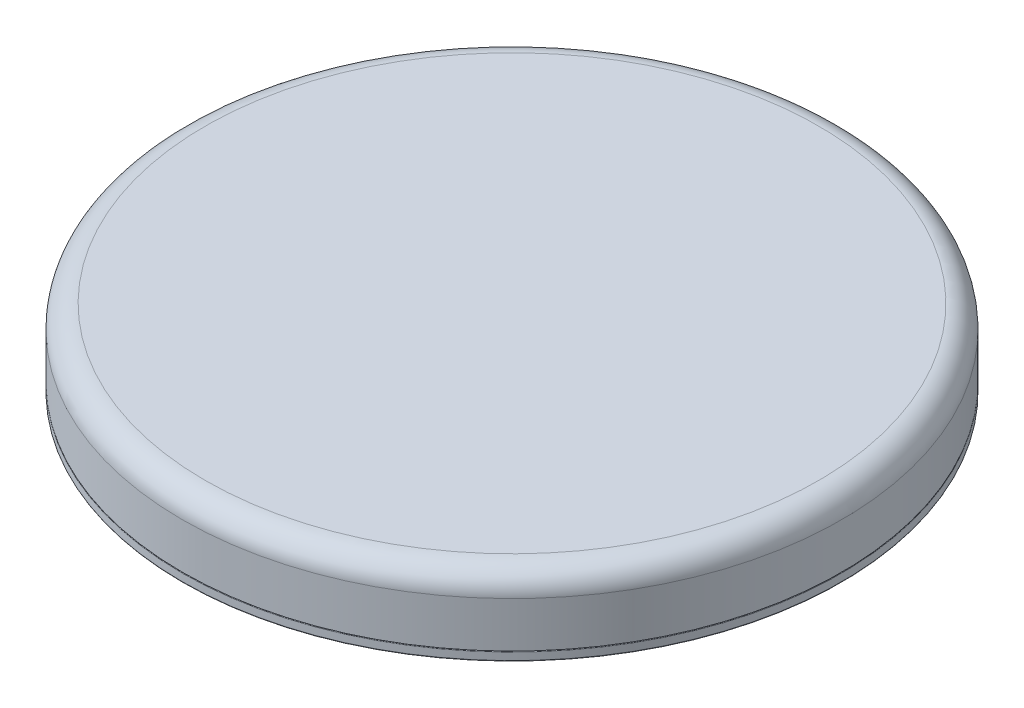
ISO-10303-21;
HEADER;
FILE_DESCRIPTION(('STEP AP214'),'2;1');
FILE_NAME('part.step','',(''),(''),'','','');
FILE_SCHEMA(('AUTOMOTIVE_DESIGN { 1 0 10303 214 1 1 1 1 }'));
ENDSEC;
DATA;
#1=APPLICATION_CONTEXT('core data for automotive mechanical design processes');
#2=APPLICATION_PROTOCOL_DEFINITION('international standard','automotive_design',2000,#1);
#3=PRODUCT_CONTEXT('',#1,'mechanical');
#4=PRODUCT('Part','Part','',(#3));
#5=PRODUCT_RELATED_PRODUCT_CATEGORY('part','',(#4));
#6=PRODUCT_DEFINITION_FORMATION('','',#4);
#7=PRODUCT_DEFINITION_CONTEXT('part definition',#1,'design');
#8=PRODUCT_DEFINITION('design','',#6,#7);
#9=PRODUCT_DEFINITION_SHAPE('','',#8);
#10=(LENGTH_UNIT() NAMED_UNIT(*) SI_UNIT(.MILLI.,.METRE.));
#11=(NAMED_UNIT(*) PLANE_ANGLE_UNIT() SI_UNIT($,.RADIAN.));
#12=(NAMED_UNIT(*) SI_UNIT($,.STERADIAN.) SOLID_ANGLE_UNIT());
#13=UNCERTAINTY_MEASURE_WITH_UNIT(LENGTH_MEASURE(1.E-05),#10,'distance_accuracy_value','');
#14=(GEOMETRIC_REPRESENTATION_CONTEXT(3) GLOBAL_UNCERTAINTY_ASSIGNED_CONTEXT((#13)) GLOBAL_UNIT_ASSIGNED_CONTEXT((#10,
#11,#12)) REPRESENTATION_CONTEXT('',''));
#15=CARTESIAN_POINT('',(0.,0.,0.));
#16=DIRECTION('',(0.,0.,1.));
#17=DIRECTION('',(1.,0.,0.));
#18=AXIS2_PLACEMENT_3D('',#15,#16,#17);
#19=CARTESIAN_POINT('',(0.,17.,0.));
#20=DIRECTION('',(0.,-1.,0.));
#21=DIRECTION('',(0.,0.,-1.));
#22=AXIS2_PLACEMENT_3D('',#19,#20,#21);
#23=CYLINDRICAL_SURFACE('',#22,72.5);
#24=CARTESIAN_POINT('',(0.,12.,0.));
#25=DIRECTION('',(0.,1.,0.));
#26=DIRECTION('',(0.,0.,1.));
#27=AXIS2_PLACEMENT_3D('',#24,#25,#26);
#28=CIRCLE('',#27,72.5);
#29=CARTESIAN_POINT('',(0.,12.,72.5));
#30=VERTEX_POINT('',#29);
#31=EDGE_CURVE('E11',#30,#30,#28,.F.);
#32=ORIENTED_EDGE('',*,*,#31,.T.);
#33=EDGE_LOOP('',(#32));
#34=FACE_BOUND('',#33,.T.);
#35=CARTESIAN_POINT('',(0.,2.,0.));
#36=DIRECTION('',(0.,1.,0.));
#37=DIRECTION('',(0.,0.,1.));
#38=AXIS2_PLACEMENT_3D('',#35,#36,#37);
#39=CIRCLE('',#38,72.5);
#40=CARTESIAN_POINT('',(0.,2.,72.5));
#41=VERTEX_POINT('',#40);
#42=EDGE_CURVE('E55',#41,#41,#39,.T.);
#43=ORIENTED_EDGE('',*,*,#42,.T.);
#44=EDGE_LOOP('',(#43));
#45=FACE_BOUND('',#44,.T.);
#46=ADVANCED_FACE('F44',(#34,#45),#23,.T.);
#47=CARTESIAN_POINT('',(0.,17.,0.));
#48=DIRECTION('',(0.,1.,0.));
#49=DIRECTION('',(0.,0.,1.));
#50=AXIS2_PLACEMENT_3D('',#47,#48,#49);
#51=PLANE('',#50);
#52=CARTESIAN_POINT('',(0.,17.,0.));
#53=DIRECTION('',(0.,1.,0.));
#54=DIRECTION('',(0.,0.,1.));
#55=AXIS2_PLACEMENT_3D('',#52,#53,#54);
#56=CIRCLE('',#55,67.5);
#57=CARTESIAN_POINT('',(0.,17.,67.5));
#58=VERTEX_POINT('',#57);
#59=EDGE_CURVE('E51',#58,#58,#56,.T.);
#60=ORIENTED_EDGE('',*,*,#59,.T.);
#61=EDGE_LOOP('',(#60));
#62=FACE_BOUND('',#61,.T.);
#63=ADVANCED_FACE('F65',(#62),#51,.T.);
#64=CARTESIAN_POINT('',(0.,2.,0.));
#65=DIRECTION('',(0.,1.,0.));
#66=DIRECTION('',(0.,0.,1.));
#67=AXIS2_PLACEMENT_3D('',#64,#65,#66);
#68=PLANE('',#67);
#69=ORIENTED_EDGE('',*,*,#42,.F.);
#70=EDGE_LOOP('',(#69));
#71=FACE_BOUND('',#70,.T.);
#72=ADVANCED_FACE('F63',(#71),#68,.F.);
#73=CARTESIAN_POINT('',(0.,12.,0.));
#74=DIRECTION('',(0.,1.,0.));
#75=DIRECTION('',(0.,0.,1.));
#76=AXIS2_PLACEMENT_3D('',#73,#74,#75);
#77=TOROIDAL_SURFACE('',#76,67.5,5.);
#78=ORIENTED_EDGE('',*,*,#31,.F.);
#79=EDGE_LOOP('',(#78));
#80=FACE_BOUND('',#79,.T.);
#81=ORIENTED_EDGE('',*,*,#59,.F.);
#82=EDGE_LOOP('',(#81));
#83=FACE_BOUND('',#82,.T.);
#84=ADVANCED_FACE('F46',(#80,#83),#77,.T.);
#85=CLOSED_SHELL('',(#46,#63,#72,#84));
#86=MANIFOLD_SOLID_BREP('B2',#85);
#87=CARTESIAN_POINT('',(0.,2.,0.));
#88=DIRECTION('',(0.,-1.,0.));
#89=DIRECTION('',(0.,0.,-1.));
#90=AXIS2_PLACEMENT_3D('',#87,#88,#89);
#91=CYLINDRICAL_SURFACE('',#90,72.5);
#92=CARTESIAN_POINT('',(0.,0.2,0.));
#93=DIRECTION('',(0.,1.,0.));
#94=DIRECTION('',(0.,0.,1.));
#95=AXIS2_PLACEMENT_3D('',#92,#93,#94);
#96=CIRCLE('',#95,72.5);
#97=CARTESIAN_POINT('',(0.,0.2,72.5));
#98=VERTEX_POINT('',#97);
#99=EDGE_CURVE('E131',#98,#98,#96,.T.);
#100=ORIENTED_EDGE('',*,*,#99,.T.);
#101=EDGE_LOOP('',(#100));
#102=FACE_BOUND('',#101,.T.);
#103=CARTESIAN_POINT('',(0.,1.8,0.));
#104=DIRECTION('',(0.,1.,0.));
#105=DIRECTION('',(0.,0.,1.));
#106=AXIS2_PLACEMENT_3D('',#103,#104,#105);
#107=CIRCLE('',#106,72.5);
#108=CARTESIAN_POINT('',(0.,1.8,72.5));
#109=VERTEX_POINT('',#108);
#110=EDGE_CURVE('E134',#109,#109,#107,.F.);
#111=ORIENTED_EDGE('',*,*,#110,.T.);
#112=EDGE_LOOP('',(#111));
#113=FACE_BOUND('',#112,.T.);
#114=ADVANCED_FACE('F99',(#102,#113),#91,.T.);
#115=CARTESIAN_POINT('',(0.,2.,0.));
#116=DIRECTION('',(0.,1.,0.));
#117=DIRECTION('',(0.,0.,1.));
#118=AXIS2_PLACEMENT_3D('',#115,#116,#117);
#119=PLANE('',#118);
#120=CARTESIAN_POINT('',(0.,2.,0.));
#121=DIRECTION('',(0.,1.,0.));
#122=DIRECTION('',(0.,0.,1.));
#123=AXIS2_PLACEMENT_3D('',#120,#121,#122);
#124=CIRCLE('',#123,72.3);
#125=CARTESIAN_POINT('',(0.,2.,72.3));
#126=VERTEX_POINT('',#125);
#127=EDGE_CURVE('E125',#126,#126,#124,.T.);
#128=ORIENTED_EDGE('',*,*,#127,.T.);
#129=EDGE_LOOP('',(#128));
#130=FACE_BOUND('',#129,.T.);
#131=ADVANCED_FACE('F161',(#130),#119,.T.);
#132=CARTESIAN_POINT('',(0.,0.,0.));
#133=DIRECTION('',(0.,1.,0.));
#134=DIRECTION('',(0.,0.,1.));
#135=AXIS2_PLACEMENT_3D('',#132,#133,#134);
#136=PLANE('',#135);
#137=CARTESIAN_POINT('',(0.,0.,0.));
#138=DIRECTION('',(0.,1.,0.));
#139=DIRECTION('',(0.,0.,1.));
#140=AXIS2_PLACEMENT_3D('',#137,#138,#139);
#141=CIRCLE('',#140,11.2);
#142=CARTESIAN_POINT('',(0.,0.,11.2));
#143=VERTEX_POINT('',#142);
#144=EDGE_CURVE('E114',#143,#143,#141,.T.);
#145=ORIENTED_EDGE('',*,*,#144,.T.);
#146=EDGE_LOOP('',(#145));
#147=FACE_BOUND('',#146,.T.);
#148=CARTESIAN_POINT('',(0.,0.,0.));
#149=DIRECTION('',(0.,1.,0.));
#150=DIRECTION('',(0.,0.,1.));
#151=AXIS2_PLACEMENT_3D('',#148,#149,#150);
#152=CIRCLE('',#151,72.3);
#153=CARTESIAN_POINT('',(0.,0.,72.3));
#154=VERTEX_POINT('',#153);
#155=EDGE_CURVE('E128',#154,#154,#152,.F.);
#156=ORIENTED_EDGE('',*,*,#155,.T.);
#157=EDGE_LOOP('',(#156));
#158=FACE_BOUND('',#157,.T.);
#159=ADVANCED_FACE('F167',(#147,#158),#136,.F.);
#160=CARTESIAN_POINT('',(0.,0.2,0.));
#161=DIRECTION('',(0.,1.,0.));
#162=DIRECTION('',(0.,0.,1.));
#163=AXIS2_PLACEMENT_3D('',#160,#161,#162);
#164=TOROIDAL_SURFACE('',#163,72.3,0.2);
#165=ORIENTED_EDGE('',*,*,#155,.F.);
#166=EDGE_LOOP('',(#165));
#167=FACE_BOUND('',#166,.T.);
#168=ORIENTED_EDGE('',*,*,#99,.F.);
#169=EDGE_LOOP('',(#168));
#170=FACE_BOUND('',#169,.T.);
#171=ADVANCED_FACE('F156',(#167,#170),#164,.T.);
#172=CARTESIAN_POINT('',(0.,1.8,0.));
#173=DIRECTION('',(0.,1.,0.));
#174=DIRECTION('',(0.,0.,1.));
#175=AXIS2_PLACEMENT_3D('',#172,#173,#174);
#176=TOROIDAL_SURFACE('',#175,72.3,0.2);
#177=ORIENTED_EDGE('',*,*,#110,.F.);
#178=EDGE_LOOP('',(#177));
#179=FACE_BOUND('',#178,.T.);
#180=ORIENTED_EDGE('',*,*,#127,.F.);
#181=EDGE_LOOP('',(#180));
#182=FACE_BOUND('',#181,.T.);
#183=ADVANCED_FACE('F146',(#179,#182),#176,.T.);
#184=CARTESIAN_POINT('',(0.,-4.,0.));
#185=DIRECTION('',(0.,1.,0.));
#186=DIRECTION('',(0.,0.,1.));
#187=AXIS2_PLACEMENT_3D('',#184,#185,#186);
#188=CYLINDRICAL_SURFACE('',#187,7.5);
#189=CARTESIAN_POINT('',(0.,-3.8,0.));
#190=DIRECTION('',(0.,-1.,0.));
#191=DIRECTION('',(0.,0.,-1.));
#192=AXIS2_PLACEMENT_3D('',#189,#190,#191);
#193=CIRCLE('',#192,7.5);
#194=CARTESIAN_POINT('',(0.,-3.8,-7.5));
#195=VERTEX_POINT('',#194);
#196=EDGE_CURVE('E110',#195,#195,#193,.T.);
#197=ORIENTED_EDGE('',*,*,#196,.T.);
#198=EDGE_LOOP('',(#197));
#199=FACE_BOUND('',#198,.T.);
#200=CARTESIAN_POINT('',(0.,0.,0.));
#201=DIRECTION('',(0.,-1.,0.));
#202=DIRECTION('',(0.,0.,-1.));
#203=AXIS2_PLACEMENT_3D('',#200,#201,#202);
#204=CIRCLE('',#203,7.5);
#205=CARTESIAN_POINT('',(0.,0.,-7.5));
#206=VERTEX_POINT('',#205);
#207=EDGE_CURVE('E137',#206,#206,#204,.T.);
#208=ORIENTED_EDGE('',*,*,#207,.F.);
#209=EDGE_LOOP('',(#208));
#210=FACE_BOUND('',#209,.T.);
#211=ADVANCED_FACE('F143',(#199,#210),#188,.F.);
#212=CARTESIAN_POINT('',(0.,-4.,0.));
#213=DIRECTION('',(0.,1.,0.));
#214=DIRECTION('',(0.,0.,1.));
#215=AXIS2_PLACEMENT_3D('',#212,#213,#214);
#216=CYLINDRICAL_SURFACE('',#215,11.);
#217=CARTESIAN_POINT('',(0.,-0.2,0.));
#218=DIRECTION('',(0.,1.,0.));
#219=DIRECTION('',(0.,0.,1.));
#220=AXIS2_PLACEMENT_3D('',#217,#218,#219);
#221=CIRCLE('',#220,11.);
#222=CARTESIAN_POINT('',(0.,-0.2,11.));
#223=VERTEX_POINT('',#222);
#224=EDGE_CURVE('E119',#223,#223,#221,.F.);
#225=ORIENTED_EDGE('',*,*,#224,.T.);
#226=EDGE_LOOP('',(#225));
#227=FACE_BOUND('',#226,.T.);
#228=CARTESIAN_POINT('',(0.,-3.8,0.));
#229=DIRECTION('',(0.,-1.,0.));
#230=DIRECTION('',(0.,0.,-1.));
#231=AXIS2_PLACEMENT_3D('',#228,#229,#230);
#232=CIRCLE('',#231,11.);
#233=CARTESIAN_POINT('',(0.,-3.8,-11.));
#234=VERTEX_POINT('',#233);
#235=EDGE_CURVE('E122',#234,#234,#232,.F.);
#236=ORIENTED_EDGE('',*,*,#235,.T.);
#237=EDGE_LOOP('',(#236));
#238=FACE_BOUND('',#237,.T.);
#239=ADVANCED_FACE('F145',(#227,#238),#216,.T.);
#240=CARTESIAN_POINT('',(0.,-4.,0.));
#241=DIRECTION('',(0.,-1.,0.));
#242=DIRECTION('',(0.,0.,-1.));
#243=AXIS2_PLACEMENT_3D('',#240,#241,#242);
#244=PLANE('',#243);
#245=CARTESIAN_POINT('',(0.,-4.,0.));
#246=DIRECTION('',(0.,-1.,0.));
#247=DIRECTION('',(0.,0.,-1.));
#248=AXIS2_PLACEMENT_3D('',#245,#246,#247);
#249=CIRCLE('',#248,7.7);
#250=CARTESIAN_POINT('',(0.,-4.,-7.7));
#251=VERTEX_POINT('',#250);
#252=EDGE_CURVE('E43',#251,#251,#249,.F.);
#253=ORIENTED_EDGE('',*,*,#252,.T.);
#254=EDGE_LOOP('',(#253));
#255=FACE_BOUND('',#254,.T.);
#256=CARTESIAN_POINT('',(0.,-4.,0.));
#257=DIRECTION('',(0.,-1.,0.));
#258=DIRECTION('',(0.,0.,-1.));
#259=AXIS2_PLACEMENT_3D('',#256,#257,#258);
#260=CIRCLE('',#259,10.8);
#261=CARTESIAN_POINT('',(0.,-4.,-10.8));
#262=VERTEX_POINT('',#261);
#263=EDGE_CURVE('E106',#262,#262,#260,.T.);
#264=ORIENTED_EDGE('',*,*,#263,.T.);
#265=EDGE_LOOP('',(#264));
#266=FACE_BOUND('',#265,.T.);
#267=ADVANCED_FACE('F153',(#255,#266),#244,.T.);
#268=ORIENTED_EDGE('',*,*,#207,.T.);
#269=EDGE_LOOP('',(#268));
#270=FACE_BOUND('',#269,.T.);
#271=ADVANCED_FACE('F141',(#270),#136,.F.);
#272=CARTESIAN_POINT('',(0.,-0.2,0.));
#273=DIRECTION('',(0.,1.,0.));
#274=DIRECTION('',(0.,0.,1.));
#275=AXIS2_PLACEMENT_3D('',#272,#273,#274);
#276=TOROIDAL_SURFACE('',#275,11.2,0.2);
#277=ORIENTED_EDGE('',*,*,#144,.F.);
#278=EDGE_LOOP('',(#277));
#279=FACE_BOUND('',#278,.T.);
#280=ORIENTED_EDGE('',*,*,#224,.F.);
#281=EDGE_LOOP('',(#280));
#282=FACE_BOUND('',#281,.T.);
#283=ADVANCED_FACE('F175',(#279,#282),#276,.F.);
#284=CARTESIAN_POINT('',(0.,-3.8,0.));
#285=DIRECTION('',(0.,-1.,0.));
#286=DIRECTION('',(0.,0.,-1.));
#287=AXIS2_PLACEMENT_3D('',#284,#285,#286);
#288=TOROIDAL_SURFACE('',#287,7.7,0.2);
#289=ORIENTED_EDGE('',*,*,#252,.F.);
#290=EDGE_LOOP('',(#289));
#291=FACE_BOUND('',#290,.T.);
#292=ORIENTED_EDGE('',*,*,#196,.F.);
#293=EDGE_LOOP('',(#292));
#294=FACE_BOUND('',#293,.T.);
#295=ADVANCED_FACE('F177',(#291,#294),#288,.T.);
#296=CARTESIAN_POINT('',(0.,-3.8,0.));
#297=DIRECTION('',(0.,-1.,0.));
#298=DIRECTION('',(0.,0.,-1.));
#299=AXIS2_PLACEMENT_3D('',#296,#297,#298);
#300=TOROIDAL_SURFACE('',#299,10.8,0.2);
#301=ORIENTED_EDGE('',*,*,#235,.F.);
#302=EDGE_LOOP('',(#301));
#303=FACE_BOUND('',#302,.T.);
#304=ORIENTED_EDGE('',*,*,#263,.F.);
#305=EDGE_LOOP('',(#304));
#306=FACE_BOUND('',#305,.T.);
#307=ADVANCED_FACE('F101',(#303,#306),#300,.T.);
#308=CLOSED_SHELL('',(#114,#131,#159,#171,#183,#211,#239,#267,#271,#283,#295,#307));
#309=MANIFOLD_SOLID_BREP('B6',#308);
#310=ADVANCED_BREP_SHAPE_REPRESENTATION('',(#18,#86,#309),#14);
#311=SHAPE_DEFINITION_REPRESENTATION(#9,#310);
ENDSEC;
END-ISO-10303-21;
